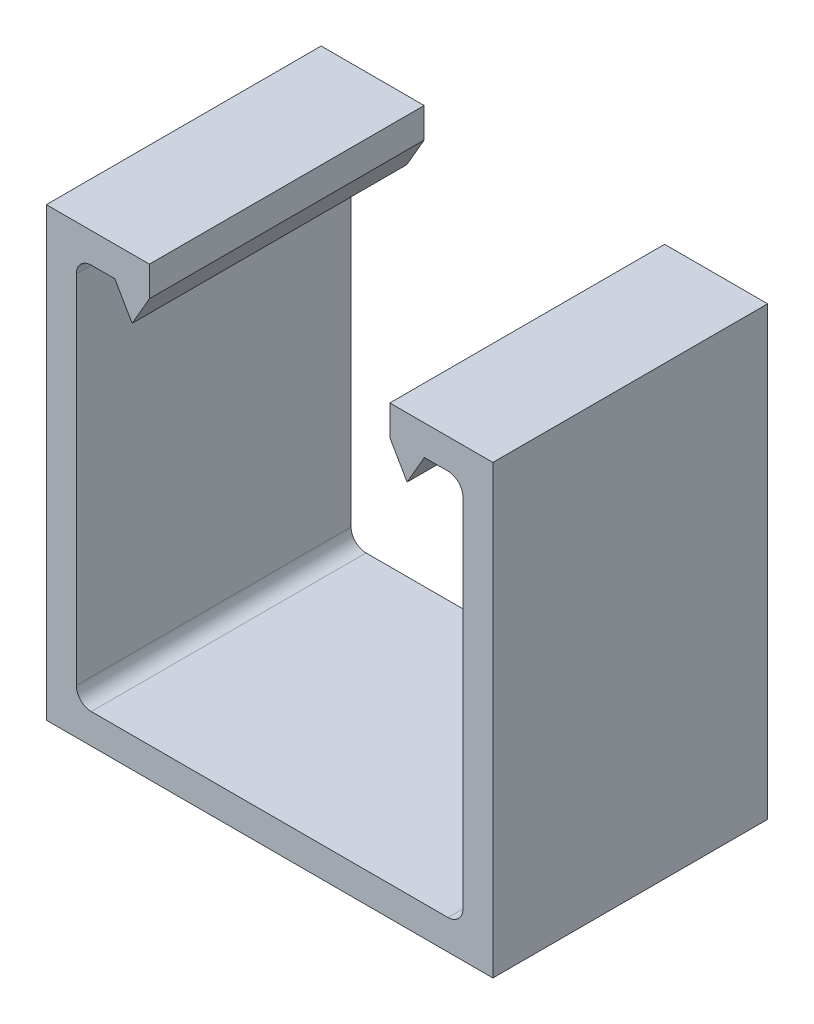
ISO-10303-21;
HEADER;
FILE_DESCRIPTION(('STEP AP214'),'2;1');
FILE_NAME('part.step','',(''),(''),'','','');
FILE_SCHEMA(('AUTOMOTIVE_DESIGN { 1 0 10303 214 1 1 1 1 }'));
ENDSEC;
DATA;
#1=APPLICATION_CONTEXT('core data for automotive mechanical design processes');
#2=APPLICATION_PROTOCOL_DEFINITION('international standard','automotive_design',2000,#1);
#3=PRODUCT_CONTEXT('',#1,'mechanical');
#4=PRODUCT('Part','Part','',(#3));
#5=PRODUCT_RELATED_PRODUCT_CATEGORY('part','',(#4));
#6=PRODUCT_DEFINITION_FORMATION('','',#4);
#7=PRODUCT_DEFINITION_CONTEXT('part definition',#1,'design');
#8=PRODUCT_DEFINITION('design','',#6,#7);
#9=PRODUCT_DEFINITION_SHAPE('','',#8);
#10=(LENGTH_UNIT() NAMED_UNIT(*) SI_UNIT(.MILLI.,.METRE.));
#11=(NAMED_UNIT(*) PLANE_ANGLE_UNIT() SI_UNIT($,.RADIAN.));
#12=(NAMED_UNIT(*) SI_UNIT($,.STERADIAN.) SOLID_ANGLE_UNIT());
#13=UNCERTAINTY_MEASURE_WITH_UNIT(LENGTH_MEASURE(1.E-05),#10,'distance_accuracy_value','');
#14=(GEOMETRIC_REPRESENTATION_CONTEXT(3) GLOBAL_UNCERTAINTY_ASSIGNED_CONTEXT((#13)) GLOBAL_UNIT_ASSIGNED_CONTEXT((#10,
#11,#12)) REPRESENTATION_CONTEXT('',''));
#15=CARTESIAN_POINT('',(0.,0.,0.));
#16=DIRECTION('',(0.,0.,1.));
#17=DIRECTION('',(1.,0.,0.));
#18=AXIS2_PLACEMENT_3D('',#15,#16,#17);
#19=CARTESIAN_POINT('',(-16.4846,-16.4846,12.7));
#20=DIRECTION('',(0.,0.,-1.));
#21=DIRECTION('',(-1.,0.,0.));
#22=AXIS2_PLACEMENT_3D('',#19,#20,#21);
#23=CYLINDRICAL_SURFACE('',#22,1.3843);
#24=CARTESIAN_POINT('',(-16.4846,-16.4846,-12.7));
#25=DIRECTION('',(0.,0.,-1.));
#26=DIRECTION('',(1.,0.,0.));
#27=AXIS2_PLACEMENT_3D('',#24,#25,#26);
#28=CIRCLE('',#27,1.3843);
#29=CARTESIAN_POINT('',(-16.4846,-17.8689,-12.7));
#30=VERTEX_POINT('',#29);
#31=CARTESIAN_POINT('',(-17.8689,-16.4846,-12.7));
#32=VERTEX_POINT('',#31);
#33=EDGE_CURVE('E210',#30,#32,#28,.T.);
#34=ORIENTED_EDGE('',*,*,#33,.T.);
#35=DIRECTION('',(0.,0.,-1.));
#36=VECTOR('',#35,1.);
#37=CARTESIAN_POINT('',(-17.8689,-16.4846,12.7));
#38=LINE('',#37,#36);
#39=CARTESIAN_POINT('',(-17.8689,-16.4846,12.7));
#40=VERTEX_POINT('',#39);
#41=EDGE_CURVE('E11',#40,#32,#38,.T.);
#42=ORIENTED_EDGE('',*,*,#41,.F.);
#43=CARTESIAN_POINT('',(-16.4846,-16.4846,12.7));
#44=DIRECTION('',(0.,0.,-1.));
#45=DIRECTION('',(1.,0.,0.));
#46=AXIS2_PLACEMENT_3D('',#43,#44,#45);
#47=CIRCLE('',#46,1.3843);
#48=CARTESIAN_POINT('',(-16.4846,-17.8689,12.7));
#49=VERTEX_POINT('',#48);
#50=EDGE_CURVE('E244',#49,#40,#47,.T.);
#51=ORIENTED_EDGE('',*,*,#50,.F.);
#52=DIRECTION('',(0.,0.,-1.));
#53=VECTOR('',#52,1.);
#54=CARTESIAN_POINT('',(-16.4846,-17.8689,12.7));
#55=LINE('',#54,#53);
#56=EDGE_CURVE('E205',#49,#30,#55,.T.);
#57=ORIENTED_EDGE('',*,*,#56,.T.);
#58=EDGE_LOOP('',(#34,#42,#51,#57));
#59=FACE_BOUND('',#58,.T.);
#60=ADVANCED_FACE('F39',(#59),#23,.F.);
#61=CARTESIAN_POINT('',(-17.8689,16.4846,12.7));
#62=DIRECTION('',(-1.,0.,0.));
#63=DIRECTION('',(0.,0.,1.));
#64=AXIS2_PLACEMENT_3D('',#61,#62,#63);
#65=PLANE('',#64);
#66=DIRECTION('',(0.,1.,0.));
#67=VECTOR('',#66,1.);
#68=CARTESIAN_POINT('',(-17.8689,16.4846,-12.7));
#69=LINE('',#68,#67);
#70=CARTESIAN_POINT('',(-17.8689,16.4846,-12.7));
#71=VERTEX_POINT('',#70);
#72=EDGE_CURVE('E208',#32,#71,#69,.T.);
#73=ORIENTED_EDGE('',*,*,#72,.T.);
#74=DIRECTION('',(0.,0.,-1.));
#75=VECTOR('',#74,1.);
#76=CARTESIAN_POINT('',(-17.8689,16.4846,12.7));
#77=LINE('',#76,#75);
#78=CARTESIAN_POINT('',(-17.8689,16.4846,12.7));
#79=VERTEX_POINT('',#78);
#80=EDGE_CURVE('E50',#79,#71,#77,.T.);
#81=ORIENTED_EDGE('',*,*,#80,.F.);
#82=DIRECTION('',(0.,1.,0.));
#83=VECTOR('',#82,1.);
#84=CARTESIAN_POINT('',(-17.8689,16.4846,12.7));
#85=LINE('',#84,#83);
#86=EDGE_CURVE('E135',#40,#79,#85,.T.);
#87=ORIENTED_EDGE('',*,*,#86,.F.);
#88=ORIENTED_EDGE('',*,*,#41,.T.);
#89=EDGE_LOOP('',(#73,#81,#87,#88));
#90=FACE_BOUND('',#89,.T.);
#91=ADVANCED_FACE('F361',(#90),#65,.F.);
#92=CARTESIAN_POINT('',(-16.4846,16.4846,12.7));
#93=DIRECTION('',(0.,0.,-1.));
#94=DIRECTION('',(-1.,0.,0.));
#95=AXIS2_PLACEMENT_3D('',#92,#93,#94);
#96=CYLINDRICAL_SURFACE('',#95,1.3843);
#97=CARTESIAN_POINT('',(-16.4846,16.4846,-12.7));
#98=DIRECTION('',(0.,0.,-1.));
#99=DIRECTION('',(1.,0.,0.));
#100=AXIS2_PLACEMENT_3D('',#97,#98,#99);
#101=CIRCLE('',#100,1.3843);
#102=CARTESIAN_POINT('',(-16.4846,17.8689,-12.7));
#103=VERTEX_POINT('',#102);
#104=EDGE_CURVE('E215',#71,#103,#101,.T.);
#105=ORIENTED_EDGE('',*,*,#104,.T.);
#106=DIRECTION('',(0.,0.,-1.));
#107=VECTOR('',#106,1.);
#108=CARTESIAN_POINT('',(-16.4846,17.8689,12.7));
#109=LINE('',#108,#107);
#110=CARTESIAN_POINT('',(-16.4846,17.8689,12.7));
#111=VERTEX_POINT('',#110);
#112=EDGE_CURVE('E290',#111,#103,#109,.T.);
#113=ORIENTED_EDGE('',*,*,#112,.F.);
#114=CARTESIAN_POINT('',(-16.4846,16.4846,12.7));
#115=DIRECTION('',(0.,0.,-1.));
#116=DIRECTION('',(1.,0.,0.));
#117=AXIS2_PLACEMENT_3D('',#114,#115,#116);
#118=CIRCLE('',#117,1.3843);
#119=EDGE_CURVE('E298',#79,#111,#118,.T.);
#120=ORIENTED_EDGE('',*,*,#119,.F.);
#121=ORIENTED_EDGE('',*,*,#80,.T.);
#122=EDGE_LOOP('',(#105,#113,#120,#121));
#123=FACE_BOUND('',#122,.T.);
#124=ADVANCED_FACE('F295',(#123),#96,.F.);
#125=CARTESIAN_POINT('',(-14.3094039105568,17.8689,12.7));
#126=DIRECTION('',(0.,1.,0.));
#127=DIRECTION('',(-1.,0.,0.));
#128=AXIS2_PLACEMENT_3D('',#125,#126,#127);
#129=PLANE('',#128);
#130=DIRECTION('',(1.,0.,0.));
#131=VECTOR('',#130,1.);
#132=CARTESIAN_POINT('',(-14.3094039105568,17.8689,-12.7));
#133=LINE('',#132,#131);
#134=CARTESIAN_POINT('',(-14.3094039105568,17.8689,-12.7));
#135=VERTEX_POINT('',#134);
#136=EDGE_CURVE('E211',#103,#135,#133,.T.);
#137=ORIENTED_EDGE('',*,*,#136,.T.);
#138=DIRECTION('',(0.,0.,-1.));
#139=VECTOR('',#138,1.);
#140=CARTESIAN_POINT('',(-14.3094039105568,17.8689,12.7));
#141=LINE('',#140,#139);
#142=CARTESIAN_POINT('',(-14.3094039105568,17.8689,12.7));
#143=VERTEX_POINT('',#142);
#144=EDGE_CURVE('E281',#143,#135,#141,.T.);
#145=ORIENTED_EDGE('',*,*,#144,.F.);
#146=DIRECTION('',(1.,0.,0.));
#147=VECTOR('',#146,1.);
#148=CARTESIAN_POINT('',(-14.3094039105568,17.8689,12.7));
#149=LINE('',#148,#147);
#150=EDGE_CURVE('E313',#111,#143,#149,.T.);
#151=ORIENTED_EDGE('',*,*,#150,.F.);
#152=ORIENTED_EDGE('',*,*,#112,.T.);
#153=EDGE_LOOP('',(#137,#145,#151,#152));
#154=FACE_BOUND('',#153,.T.);
#155=ADVANCED_FACE('F304',(#154),#129,.F.);
#156=CARTESIAN_POINT('',(-14.3094039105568,17.8689,12.7));
#157=DIRECTION('',(0.866025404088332,0.499999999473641,0.));
#158=DIRECTION('',(-0.499999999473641,0.866025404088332,0.));
#159=AXIS2_PLACEMENT_3D('',#156,#157,#158);
#160=PLANE('',#159);
#161=DIRECTION('',(0.499999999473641,-0.866025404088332,0.));
#162=VECTOR('',#161,1.);
#163=CARTESIAN_POINT('',(-14.3094039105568,17.8689,-12.7));
#164=LINE('',#163,#162);
#165=CARTESIAN_POINT('',(-12.710951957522,15.1003,-12.7));
#166=VERTEX_POINT('',#165);
#167=EDGE_CURVE('E218',#135,#166,#164,.T.);
#168=ORIENTED_EDGE('',*,*,#167,.T.);
#169=DIRECTION('',(0.,0.,-1.));
#170=VECTOR('',#169,1.);
#171=CARTESIAN_POINT('',(-12.710951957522,15.1003,12.7));
#172=LINE('',#171,#170);
#173=CARTESIAN_POINT('',(-12.710951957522,15.1003,12.7));
#174=VERTEX_POINT('',#173);
#175=EDGE_CURVE('E284',#174,#166,#172,.T.);
#176=ORIENTED_EDGE('',*,*,#175,.F.);
#177=DIRECTION('',(0.499999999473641,-0.866025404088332,0.));
#178=VECTOR('',#177,1.);
#179=CARTESIAN_POINT('',(-14.3094039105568,17.8689,12.7));
#180=LINE('',#179,#178);
#181=EDGE_CURVE('E311',#143,#174,#180,.T.);
#182=ORIENTED_EDGE('',*,*,#181,.F.);
#183=ORIENTED_EDGE('',*,*,#144,.T.);
#184=EDGE_LOOP('',(#168,#176,#182,#183));
#185=FACE_BOUND('',#184,.T.);
#186=ADVANCED_FACE('F307',(#185),#160,.F.);
#187=CARTESIAN_POINT('',(-12.710951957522,15.1003,12.7));
#188=DIRECTION('',(-0.866025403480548,0.500000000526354,0.));
#189=DIRECTION('',(-0.500000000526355,-0.866025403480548,0.));
#190=AXIS2_PLACEMENT_3D('',#187,#188,#189);
#191=PLANE('',#190);
#192=DIRECTION('',(0.500000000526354,0.866025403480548,0.));
#193=VECTOR('',#192,1.);
#194=CARTESIAN_POINT('',(-12.710951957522,15.1003,-12.7));
#195=LINE('',#194,#193);
#196=CARTESIAN_POINT('',(-11.1125,17.8689,-12.7));
#197=VERTEX_POINT('',#196);
#198=EDGE_CURVE('E217',#166,#197,#195,.T.);
#199=ORIENTED_EDGE('',*,*,#198,.T.);
#200=DIRECTION('',(0.,0.,-1.));
#201=VECTOR('',#200,1.);
#202=CARTESIAN_POINT('',(-11.1125,17.8689,12.7));
#203=LINE('',#202,#201);
#204=CARTESIAN_POINT('',(-11.1125,17.8689,12.7));
#205=VERTEX_POINT('',#204);
#206=EDGE_CURVE('E276',#205,#197,#203,.T.);
#207=ORIENTED_EDGE('',*,*,#206,.F.);
#208=DIRECTION('',(0.500000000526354,0.866025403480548,0.));
#209=VECTOR('',#208,1.);
#210=CARTESIAN_POINT('',(-12.710951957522,15.1003,12.7));
#211=LINE('',#210,#209);
#212=EDGE_CURVE('E312',#174,#205,#211,.T.);
#213=ORIENTED_EDGE('',*,*,#212,.F.);
#214=ORIENTED_EDGE('',*,*,#175,.T.);
#215=EDGE_LOOP('',(#199,#207,#213,#214));
#216=FACE_BOUND('',#215,.T.);
#217=ADVANCED_FACE('F376',(#216),#191,.F.);
#218=CARTESIAN_POINT('',(-11.1125,17.8689,12.7));
#219=DIRECTION('',(-1.,0.,0.));
#220=DIRECTION('',(0.,-1.,0.));
#221=AXIS2_PLACEMENT_3D('',#218,#219,#220);
#222=PLANE('',#221);
#223=DIRECTION('',(0.,1.,0.));
#224=VECTOR('',#223,1.);
#225=CARTESIAN_POINT('',(-11.1125,17.8689,-12.7));
#226=LINE('',#225,#224);
#227=CARTESIAN_POINT('',(-11.1125,20.6375,-12.7));
#228=VERTEX_POINT('',#227);
#229=EDGE_CURVE('E216',#197,#228,#226,.T.);
#230=ORIENTED_EDGE('',*,*,#229,.T.);
#231=DIRECTION('',(0.,0.,-1.));
#232=VECTOR('',#231,1.);
#233=CARTESIAN_POINT('',(-11.1125,20.6375,12.7));
#234=LINE('',#233,#232);
#235=CARTESIAN_POINT('',(-11.1125,20.6375,12.7));
#236=VERTEX_POINT('',#235);
#237=EDGE_CURVE('E277',#236,#228,#234,.T.);
#238=ORIENTED_EDGE('',*,*,#237,.F.);
#239=DIRECTION('',(0.,1.,0.));
#240=VECTOR('',#239,1.);
#241=CARTESIAN_POINT('',(-11.1125,17.8689,12.7));
#242=LINE('',#241,#240);
#243=EDGE_CURVE('E317',#205,#236,#242,.T.);
#244=ORIENTED_EDGE('',*,*,#243,.F.);
#245=ORIENTED_EDGE('',*,*,#206,.T.);
#246=EDGE_LOOP('',(#230,#238,#244,#245));
#247=FACE_BOUND('',#246,.T.);
#248=ADVANCED_FACE('F378',(#247),#222,.F.);
#249=CARTESIAN_POINT('',(-11.1125,20.6375,12.7));
#250=DIRECTION('',(0.,-1.,0.));
#251=DIRECTION('',(1.,0.,0.));
#252=AXIS2_PLACEMENT_3D('',#249,#250,#251);
#253=PLANE('',#252);
#254=DIRECTION('',(-1.,0.,0.));
#255=VECTOR('',#254,1.);
#256=CARTESIAN_POINT('',(-11.1125,20.6375,-12.7));
#257=LINE('',#256,#255);
#258=CARTESIAN_POINT('',(-20.6375,20.6375,-12.7));
#259=VERTEX_POINT('',#258);
#260=EDGE_CURVE('E224',#228,#259,#257,.T.);
#261=ORIENTED_EDGE('',*,*,#260,.T.);
#262=DIRECTION('',(0.,0.,-1.));
#263=VECTOR('',#262,1.);
#264=CARTESIAN_POINT('',(-20.6375,20.6375,12.7));
#265=LINE('',#264,#263);
#266=CARTESIAN_POINT('',(-20.6375,20.6375,12.7));
#267=VERTEX_POINT('',#266);
#268=EDGE_CURVE('E271',#267,#259,#265,.T.);
#269=ORIENTED_EDGE('',*,*,#268,.F.);
#270=DIRECTION('',(-1.,0.,0.));
#271=VECTOR('',#270,1.);
#272=CARTESIAN_POINT('',(-11.1125,20.6375,12.7));
#273=LINE('',#272,#271);
#274=EDGE_CURVE('E325',#236,#267,#273,.T.);
#275=ORIENTED_EDGE('',*,*,#274,.F.);
#276=ORIENTED_EDGE('',*,*,#237,.T.);
#277=EDGE_LOOP('',(#261,#269,#275,#276));
#278=FACE_BOUND('',#277,.T.);
#279=ADVANCED_FACE('F384',(#278),#253,.F.);
#280=CARTESIAN_POINT('',(-20.6375,20.6375,12.7));
#281=DIRECTION('',(1.,0.,0.));
#282=DIRECTION('',(0.,1.,0.));
#283=AXIS2_PLACEMENT_3D('',#280,#281,#282);
#284=PLANE('',#283);
#285=DIRECTION('',(0.,-1.,0.));
#286=VECTOR('',#285,1.);
#287=CARTESIAN_POINT('',(-20.6375,20.6375,-12.7));
#288=LINE('',#287,#286);
#289=CARTESIAN_POINT('',(-20.6375,-20.6375,-12.7));
#290=VERTEX_POINT('',#289);
#291=EDGE_CURVE('E221',#259,#290,#288,.T.);
#292=ORIENTED_EDGE('',*,*,#291,.T.);
#293=DIRECTION('',(0.,0.,-1.));
#294=VECTOR('',#293,1.);
#295=CARTESIAN_POINT('',(-20.6375,-20.6375,12.7));
#296=LINE('',#295,#294);
#297=CARTESIAN_POINT('',(-20.6375,-20.6375,12.7));
#298=VERTEX_POINT('',#297);
#299=EDGE_CURVE('E268',#298,#290,#296,.T.);
#300=ORIENTED_EDGE('',*,*,#299,.F.);
#301=DIRECTION('',(0.,-1.,0.));
#302=VECTOR('',#301,1.);
#303=CARTESIAN_POINT('',(-20.6375,20.6375,12.7));
#304=LINE('',#303,#302);
#305=EDGE_CURVE('E321',#267,#298,#304,.T.);
#306=ORIENTED_EDGE('',*,*,#305,.F.);
#307=ORIENTED_EDGE('',*,*,#268,.T.);
#308=EDGE_LOOP('',(#292,#300,#306,#307));
#309=FACE_BOUND('',#308,.T.);
#310=ADVANCED_FACE('F390',(#309),#284,.F.);
#311=CARTESIAN_POINT('',(-20.6375,-20.6375,12.7));
#312=DIRECTION('',(0.,1.,0.));
#313=DIRECTION('',(0.,0.,1.));
#314=AXIS2_PLACEMENT_3D('',#311,#312,#313);
#315=PLANE('',#314);
#316=DIRECTION('',(1.,0.,0.));
#317=VECTOR('',#316,1.);
#318=CARTESIAN_POINT('',(-20.6375,-20.6375,-12.7));
#319=LINE('',#318,#317);
#320=CARTESIAN_POINT('',(20.6375,-20.6375,-12.7));
#321=VERTEX_POINT('',#320);
#322=EDGE_CURVE('E228',#290,#321,#319,.T.);
#323=ORIENTED_EDGE('',*,*,#322,.T.);
#324=DIRECTION('',(0.,0.,-1.));
#325=VECTOR('',#324,1.);
#326=CARTESIAN_POINT('',(20.6375,-20.6375,12.7));
#327=LINE('',#326,#325);
#328=CARTESIAN_POINT('',(20.6375,-20.6375,12.7));
#329=VERTEX_POINT('',#328);
#330=EDGE_CURVE('E269',#329,#321,#327,.T.);
#331=ORIENTED_EDGE('',*,*,#330,.F.);
#332=DIRECTION('',(1.,0.,0.));
#333=VECTOR('',#332,1.);
#334=CARTESIAN_POINT('',(-20.6375,-20.6375,12.7));
#335=LINE('',#334,#333);
#336=EDGE_CURVE('E328',#298,#329,#335,.T.);
#337=ORIENTED_EDGE('',*,*,#336,.F.);
#338=ORIENTED_EDGE('',*,*,#299,.T.);
#339=EDGE_LOOP('',(#323,#331,#337,#338));
#340=FACE_BOUND('',#339,.T.);
#341=ADVANCED_FACE('F393',(#340),#315,.F.);
#342=CARTESIAN_POINT('',(20.6375,-20.6375,12.7));
#343=DIRECTION('',(-1.,0.,0.));
#344=DIRECTION('',(0.,0.,1.));
#345=AXIS2_PLACEMENT_3D('',#342,#343,#344);
#346=PLANE('',#345);
#347=DIRECTION('',(0.,1.,0.));
#348=VECTOR('',#347,1.);
#349=CARTESIAN_POINT('',(20.6375,-20.6375,-12.7));
#350=LINE('',#349,#348);
#351=CARTESIAN_POINT('',(20.6375,20.6375,-12.7));
#352=VERTEX_POINT('',#351);
#353=EDGE_CURVE('E226',#321,#352,#350,.T.);
#354=ORIENTED_EDGE('',*,*,#353,.T.);
#355=DIRECTION('',(0.,0.,-1.));
#356=VECTOR('',#355,1.);
#357=CARTESIAN_POINT('',(20.6375,20.6375,12.7));
#358=LINE('',#357,#356);
#359=CARTESIAN_POINT('',(20.6375,20.6375,12.7));
#360=VERTEX_POINT('',#359);
#361=EDGE_CURVE('E265',#360,#352,#358,.T.);
#362=ORIENTED_EDGE('',*,*,#361,.F.);
#363=DIRECTION('',(0.,1.,0.));
#364=VECTOR('',#363,1.);
#365=CARTESIAN_POINT('',(20.6375,-20.6375,12.7));
#366=LINE('',#365,#364);
#367=EDGE_CURVE('E327',#329,#360,#366,.T.);
#368=ORIENTED_EDGE('',*,*,#367,.F.);
#369=ORIENTED_EDGE('',*,*,#330,.T.);
#370=EDGE_LOOP('',(#354,#362,#368,#369));
#371=FACE_BOUND('',#370,.T.);
#372=ADVANCED_FACE('F391',(#371),#346,.F.);
#373=CARTESIAN_POINT('',(20.6375,20.6375,12.7));
#374=DIRECTION('',(0.,-1.,0.));
#375=DIRECTION('',(0.,0.,-1.));
#376=AXIS2_PLACEMENT_3D('',#373,#374,#375);
#377=PLANE('',#376);
#378=DIRECTION('',(-1.,0.,0.));
#379=VECTOR('',#378,1.);
#380=CARTESIAN_POINT('',(20.6375,20.6375,-12.7));
#381=LINE('',#380,#379);
#382=CARTESIAN_POINT('',(11.1125,20.6375,-12.7));
#383=VERTEX_POINT('',#382);
#384=EDGE_CURVE('E229',#352,#383,#381,.T.);
#385=ORIENTED_EDGE('',*,*,#384,.T.);
#386=DIRECTION('',(0.,0.,-1.));
#387=VECTOR('',#386,1.);
#388=CARTESIAN_POINT('',(11.1125,20.6375,12.7));
#389=LINE('',#388,#387);
#390=CARTESIAN_POINT('',(11.1125,20.6375,12.7));
#391=VERTEX_POINT('',#390);
#392=EDGE_CURVE('E263',#391,#383,#389,.T.);
#393=ORIENTED_EDGE('',*,*,#392,.F.);
#394=DIRECTION('',(-1.,0.,0.));
#395=VECTOR('',#394,1.);
#396=CARTESIAN_POINT('',(20.6375,20.6375,12.7));
#397=LINE('',#396,#395);
#398=EDGE_CURVE('E326',#360,#391,#397,.T.);
#399=ORIENTED_EDGE('',*,*,#398,.F.);
#400=ORIENTED_EDGE('',*,*,#361,.T.);
#401=EDGE_LOOP('',(#385,#393,#399,#400));
#402=FACE_BOUND('',#401,.T.);
#403=ADVANCED_FACE('F396',(#402),#377,.F.);
#404=CARTESIAN_POINT('',(11.1125,17.8689,12.7));
#405=DIRECTION('',(1.,0.,0.));
#406=DIRECTION('',(0.,0.,-1.));
#407=AXIS2_PLACEMENT_3D('',#404,#405,#406);
#408=PLANE('',#407);
#409=DIRECTION('',(0.,-1.,0.));
#410=VECTOR('',#409,1.);
#411=CARTESIAN_POINT('',(11.1125,17.8689,-12.7));
#412=LINE('',#411,#410);
#413=CARTESIAN_POINT('',(11.1125,17.8689,-12.7));
#414=VERTEX_POINT('',#413);
#415=EDGE_CURVE('E235',#383,#414,#412,.T.);
#416=ORIENTED_EDGE('',*,*,#415,.T.);
#417=DIRECTION('',(0.,0.,-1.));
#418=VECTOR('',#417,1.);
#419=CARTESIAN_POINT('',(11.1125,17.8689,12.7));
#420=LINE('',#419,#418);
#421=CARTESIAN_POINT('',(11.1125,17.8689,12.7));
#422=VERTEX_POINT('',#421);
#423=EDGE_CURVE('E259',#422,#414,#420,.T.);
#424=ORIENTED_EDGE('',*,*,#423,.F.);
#425=DIRECTION('',(0.,-1.,0.));
#426=VECTOR('',#425,1.);
#427=CARTESIAN_POINT('',(11.1125,17.8689,12.7));
#428=LINE('',#427,#426);
#429=EDGE_CURVE('E334',#391,#422,#428,.T.);
#430=ORIENTED_EDGE('',*,*,#429,.F.);
#431=ORIENTED_EDGE('',*,*,#392,.T.);
#432=EDGE_LOOP('',(#416,#424,#430,#431));
#433=FACE_BOUND('',#432,.T.);
#434=ADVANCED_FACE('F401',(#433),#408,.F.);
#435=CARTESIAN_POINT('',(12.710951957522,15.1003,12.7));
#436=DIRECTION('',(0.866025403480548,0.500000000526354,0.));
#437=DIRECTION('',(-0.500000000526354,0.866025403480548,0.));
#438=AXIS2_PLACEMENT_3D('',#435,#436,#437);
#439=PLANE('',#438);
#440=DIRECTION('',(0.500000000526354,-0.866025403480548,0.));
#441=VECTOR('',#440,1.);
#442=CARTESIAN_POINT('',(12.710951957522,15.1003,-12.7));
#443=LINE('',#442,#441);
#444=CARTESIAN_POINT('',(12.710951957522,15.1003,-12.7));
#445=VERTEX_POINT('',#444);
#446=EDGE_CURVE('E234',#414,#445,#443,.T.);
#447=ORIENTED_EDGE('',*,*,#446,.T.);
#448=DIRECTION('',(0.,0.,-1.));
#449=VECTOR('',#448,1.);
#450=CARTESIAN_POINT('',(12.710951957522,15.1003,12.7));
#451=LINE('',#450,#449);
#452=CARTESIAN_POINT('',(12.710951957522,15.1003,12.7));
#453=VERTEX_POINT('',#452);
#454=EDGE_CURVE('E253',#453,#445,#451,.T.);
#455=ORIENTED_EDGE('',*,*,#454,.F.);
#456=DIRECTION('',(0.500000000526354,-0.866025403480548,0.));
#457=VECTOR('',#456,1.);
#458=CARTESIAN_POINT('',(12.710951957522,15.1003,12.7));
#459=LINE('',#458,#457);
#460=EDGE_CURVE('E331',#422,#453,#459,.T.);
#461=ORIENTED_EDGE('',*,*,#460,.F.);
#462=ORIENTED_EDGE('',*,*,#423,.T.);
#463=EDGE_LOOP('',(#447,#455,#461,#462));
#464=FACE_BOUND('',#463,.T.);
#465=ADVANCED_FACE('F410',(#464),#439,.F.);
#466=CARTESIAN_POINT('',(14.3094039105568,17.8689,12.7));
#467=DIRECTION('',(-0.866025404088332,0.499999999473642,0.));
#468=DIRECTION('',(-0.499999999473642,-0.866025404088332,0.));
#469=AXIS2_PLACEMENT_3D('',#466,#467,#468);
#470=PLANE('',#469);
#471=DIRECTION('',(0.499999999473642,0.866025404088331,0.));
#472=VECTOR('',#471,1.);
#473=CARTESIAN_POINT('',(14.3094039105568,17.8689,-12.7));
#474=LINE('',#473,#472);
#475=CARTESIAN_POINT('',(14.3094039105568,17.8689,-12.7));
#476=VERTEX_POINT('',#475);
#477=EDGE_CURVE('E236',#445,#476,#474,.T.);
#478=ORIENTED_EDGE('',*,*,#477,.T.);
#479=DIRECTION('',(0.,0.,-1.));
#480=VECTOR('',#479,1.);
#481=CARTESIAN_POINT('',(14.3094039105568,17.8689,12.7));
#482=LINE('',#481,#480);
#483=CARTESIAN_POINT('',(14.3094039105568,17.8689,12.7));
#484=VERTEX_POINT('',#483);
#485=EDGE_CURVE('E255',#484,#476,#482,.T.);
#486=ORIENTED_EDGE('',*,*,#485,.F.);
#487=DIRECTION('',(0.499999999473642,0.866025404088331,0.));
#488=VECTOR('',#487,1.);
#489=CARTESIAN_POINT('',(14.3094039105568,17.8689,12.7));
#490=LINE('',#489,#488);
#491=EDGE_CURVE('E337',#453,#484,#490,.T.);
#492=ORIENTED_EDGE('',*,*,#491,.F.);
#493=ORIENTED_EDGE('',*,*,#454,.T.);
#494=EDGE_LOOP('',(#478,#486,#492,#493));
#495=FACE_BOUND('',#494,.T.);
#496=ADVANCED_FACE('F413',(#495),#470,.F.);
#497=CARTESIAN_POINT('',(16.4846,17.8689,12.7));
#498=DIRECTION('',(0.,1.,0.));
#499=DIRECTION('',(-1.,0.,0.));
#500=AXIS2_PLACEMENT_3D('',#497,#498,#499);
#501=PLANE('',#500);
#502=DIRECTION('',(1.,0.,0.));
#503=VECTOR('',#502,1.);
#504=CARTESIAN_POINT('',(16.4846,17.8689,-12.7));
#505=LINE('',#504,#503);
#506=CARTESIAN_POINT('',(16.4846,17.8689,-12.7));
#507=VERTEX_POINT('',#506);
#508=EDGE_CURVE('E238',#476,#507,#505,.T.);
#509=ORIENTED_EDGE('',*,*,#508,.T.);
#510=DIRECTION('',(0.,0.,-1.));
#511=VECTOR('',#510,1.);
#512=CARTESIAN_POINT('',(16.4846,17.8689,12.7));
#513=LINE('',#512,#511);
#514=CARTESIAN_POINT('',(16.4846,17.8689,12.7));
#515=VERTEX_POINT('',#514);
#516=EDGE_CURVE('E248',#515,#507,#513,.T.);
#517=ORIENTED_EDGE('',*,*,#516,.F.);
#518=DIRECTION('',(1.,0.,0.));
#519=VECTOR('',#518,1.);
#520=CARTESIAN_POINT('',(16.4846,17.8689,12.7));
#521=LINE('',#520,#519);
#522=EDGE_CURVE('E336',#484,#515,#521,.T.);
#523=ORIENTED_EDGE('',*,*,#522,.F.);
#524=ORIENTED_EDGE('',*,*,#485,.T.);
#525=EDGE_LOOP('',(#509,#517,#523,#524));
#526=FACE_BOUND('',#525,.T.);
#527=ADVANCED_FACE('F341',(#526),#501,.F.);
#528=CARTESIAN_POINT('',(16.4846,16.4846,12.7));
#529=DIRECTION('',(0.,0.,-1.));
#530=DIRECTION('',(-1.,0.,0.));
#531=AXIS2_PLACEMENT_3D('',#528,#529,#530);
#532=CYLINDRICAL_SURFACE('',#531,1.3843);
#533=CARTESIAN_POINT('',(16.4846,16.4846,-12.7));
#534=DIRECTION('',(0.,0.,-1.));
#535=DIRECTION('',(1.,0.,0.));
#536=AXIS2_PLACEMENT_3D('',#533,#534,#535);
#537=CIRCLE('',#536,1.3843);
#538=CARTESIAN_POINT('',(17.8689,16.4846,-12.7));
#539=VERTEX_POINT('',#538);
#540=EDGE_CURVE('E239',#507,#539,#537,.T.);
#541=ORIENTED_EDGE('',*,*,#540,.T.);
#542=DIRECTION('',(0.,0.,-1.));
#543=VECTOR('',#542,1.);
#544=CARTESIAN_POINT('',(17.8689,16.4846,12.7));
#545=LINE('',#544,#543);
#546=CARTESIAN_POINT('',(17.8689,16.4846,12.7));
#547=VERTEX_POINT('',#546);
#548=EDGE_CURVE('E197',#547,#539,#545,.T.);
#549=ORIENTED_EDGE('',*,*,#548,.F.);
#550=CARTESIAN_POINT('',(16.4846,16.4846,12.7));
#551=DIRECTION('',(0.,0.,-1.));
#552=DIRECTION('',(1.,0.,0.));
#553=AXIS2_PLACEMENT_3D('',#550,#551,#552);
#554=CIRCLE('',#553,1.3843);
#555=EDGE_CURVE('E186',#515,#547,#554,.T.);
#556=ORIENTED_EDGE('',*,*,#555,.F.);
#557=ORIENTED_EDGE('',*,*,#516,.T.);
#558=EDGE_LOOP('',(#541,#549,#556,#557));
#559=FACE_BOUND('',#558,.T.);
#560=ADVANCED_FACE('F347',(#559),#532,.F.);
#561=CARTESIAN_POINT('',(17.8689,-16.4846,12.7));
#562=DIRECTION('',(1.,0.,0.));
#563=DIRECTION('',(0.,1.,0.));
#564=AXIS2_PLACEMENT_3D('',#561,#562,#563);
#565=PLANE('',#564);
#566=DIRECTION('',(0.,-1.,0.));
#567=VECTOR('',#566,1.);
#568=CARTESIAN_POINT('',(17.8689,-16.4846,-12.7));
#569=LINE('',#568,#567);
#570=CARTESIAN_POINT('',(17.8689,-16.4846,-12.7));
#571=VERTEX_POINT('',#570);
#572=EDGE_CURVE('E199',#539,#571,#569,.T.);
#573=ORIENTED_EDGE('',*,*,#572,.T.);
#574=DIRECTION('',(0.,0.,-1.));
#575=VECTOR('',#574,1.);
#576=CARTESIAN_POINT('',(17.8689,-16.4846,12.7));
#577=LINE('',#576,#575);
#578=CARTESIAN_POINT('',(17.8689,-16.4846,12.7));
#579=VERTEX_POINT('',#578);
#580=EDGE_CURVE('E191',#579,#571,#577,.T.);
#581=ORIENTED_EDGE('',*,*,#580,.F.);
#582=DIRECTION('',(0.,-1.,0.));
#583=VECTOR('',#582,1.);
#584=CARTESIAN_POINT('',(17.8689,-16.4846,12.7));
#585=LINE('',#584,#583);
#586=EDGE_CURVE('E182',#547,#579,#585,.T.);
#587=ORIENTED_EDGE('',*,*,#586,.F.);
#588=ORIENTED_EDGE('',*,*,#548,.T.);
#589=EDGE_LOOP('',(#573,#581,#587,#588));
#590=FACE_BOUND('',#589,.T.);
#591=ADVANCED_FACE('F193',(#590),#565,.F.);
#592=CARTESIAN_POINT('',(16.4846,-16.4846,12.7));
#593=DIRECTION('',(0.,0.,-1.));
#594=DIRECTION('',(-1.,0.,0.));
#595=AXIS2_PLACEMENT_3D('',#592,#593,#594);
#596=CYLINDRICAL_SURFACE('',#595,1.3843);
#597=CARTESIAN_POINT('',(16.4846,-16.4846,-12.7));
#598=DIRECTION('',(0.,0.,-1.));
#599=DIRECTION('',(1.,0.,0.));
#600=AXIS2_PLACEMENT_3D('',#597,#598,#599);
#601=CIRCLE('',#600,1.3843);
#602=CARTESIAN_POINT('',(16.4846,-17.8689,-12.7));
#603=VERTEX_POINT('',#602);
#604=EDGE_CURVE('E119',#571,#603,#601,.T.);
#605=ORIENTED_EDGE('',*,*,#604,.T.);
#606=DIRECTION('',(0.,0.,-1.));
#607=VECTOR('',#606,1.);
#608=CARTESIAN_POINT('',(16.4846,-17.8689,12.7));
#609=LINE('',#608,#607);
#610=CARTESIAN_POINT('',(16.4846,-17.8689,12.7));
#611=VERTEX_POINT('',#610);
#612=EDGE_CURVE('E200',#611,#603,#609,.T.);
#613=ORIENTED_EDGE('',*,*,#612,.F.);
#614=CARTESIAN_POINT('',(16.4846,-16.4846,12.7));
#615=DIRECTION('',(0.,0.,-1.));
#616=DIRECTION('',(1.,0.,0.));
#617=AXIS2_PLACEMENT_3D('',#614,#615,#616);
#618=CIRCLE('',#617,1.3843);
#619=EDGE_CURVE('E190',#579,#611,#618,.T.);
#620=ORIENTED_EDGE('',*,*,#619,.F.);
#621=ORIENTED_EDGE('',*,*,#580,.T.);
#622=EDGE_LOOP('',(#605,#613,#620,#621));
#623=FACE_BOUND('',#622,.T.);
#624=ADVANCED_FACE('F202',(#623),#596,.F.);
#625=CARTESIAN_POINT('',(-16.4846,-17.8689,12.7));
#626=DIRECTION('',(0.,-1.,0.));
#627=DIRECTION('',(0.,0.,-1.));
#628=AXIS2_PLACEMENT_3D('',#625,#626,#627);
#629=PLANE('',#628);
#630=DIRECTION('',(-1.,0.,0.));
#631=VECTOR('',#630,1.);
#632=CARTESIAN_POINT('',(-16.4846,-17.8689,-12.7));
#633=LINE('',#632,#631);
#634=EDGE_CURVE('E127',#603,#30,#633,.T.);
#635=ORIENTED_EDGE('',*,*,#634,.T.);
#636=ORIENTED_EDGE('',*,*,#56,.F.);
#637=DIRECTION('',(-1.,0.,0.));
#638=VECTOR('',#637,1.);
#639=CARTESIAN_POINT('',(-16.4846,-17.8689,12.7));
#640=LINE('',#639,#638);
#641=EDGE_CURVE('E54',#611,#49,#640,.T.);
#642=ORIENTED_EDGE('',*,*,#641,.F.);
#643=ORIENTED_EDGE('',*,*,#612,.T.);
#644=EDGE_LOOP('',(#635,#636,#642,#643));
#645=FACE_BOUND('',#644,.T.);
#646=ADVANCED_FACE('F354',(#645),#629,.F.);
#647=CARTESIAN_POINT('',(-16.4846,-16.4846,12.7));
#648=DIRECTION('',(0.,0.,1.));
#649=DIRECTION('',(1.,0.,0.));
#650=AXIS2_PLACEMENT_3D('',#647,#648,#649);
#651=PLANE('',#650);
#652=ORIENTED_EDGE('',*,*,#50,.T.);
#653=ORIENTED_EDGE('',*,*,#86,.T.);
#654=ORIENTED_EDGE('',*,*,#119,.T.);
#655=ORIENTED_EDGE('',*,*,#150,.T.);
#656=ORIENTED_EDGE('',*,*,#181,.T.);
#657=ORIENTED_EDGE('',*,*,#212,.T.);
#658=ORIENTED_EDGE('',*,*,#243,.T.);
#659=ORIENTED_EDGE('',*,*,#274,.T.);
#660=ORIENTED_EDGE('',*,*,#305,.T.);
#661=ORIENTED_EDGE('',*,*,#336,.T.);
#662=ORIENTED_EDGE('',*,*,#367,.T.);
#663=ORIENTED_EDGE('',*,*,#398,.T.);
#664=ORIENTED_EDGE('',*,*,#429,.T.);
#665=ORIENTED_EDGE('',*,*,#460,.T.);
#666=ORIENTED_EDGE('',*,*,#491,.T.);
#667=ORIENTED_EDGE('',*,*,#522,.T.);
#668=ORIENTED_EDGE('',*,*,#555,.T.);
#669=ORIENTED_EDGE('',*,*,#586,.T.);
#670=ORIENTED_EDGE('',*,*,#619,.T.);
#671=ORIENTED_EDGE('',*,*,#641,.T.);
#672=EDGE_LOOP('',(#652,#653,#654,#655,#656,#657,#658,#659,#660,#661,#662,#663,#664,#665,#666,
#667,#668,#669,#670,#671));
#673=FACE_BOUND('',#672,.T.);
#674=ADVANCED_FACE('F184',(#673),#651,.T.);
#675=CARTESIAN_POINT('',(-16.4846,-16.4846,-12.7));
#676=DIRECTION('',(0.,0.,1.));
#677=DIRECTION('',(1.,0.,0.));
#678=AXIS2_PLACEMENT_3D('',#675,#676,#677);
#679=PLANE('',#678);
#680=ORIENTED_EDGE('',*,*,#33,.F.);
#681=ORIENTED_EDGE('',*,*,#634,.F.);
#682=ORIENTED_EDGE('',*,*,#604,.F.);
#683=ORIENTED_EDGE('',*,*,#572,.F.);
#684=ORIENTED_EDGE('',*,*,#540,.F.);
#685=ORIENTED_EDGE('',*,*,#508,.F.);
#686=ORIENTED_EDGE('',*,*,#477,.F.);
#687=ORIENTED_EDGE('',*,*,#446,.F.);
#688=ORIENTED_EDGE('',*,*,#415,.F.);
#689=ORIENTED_EDGE('',*,*,#384,.F.);
#690=ORIENTED_EDGE('',*,*,#353,.F.);
#691=ORIENTED_EDGE('',*,*,#322,.F.);
#692=ORIENTED_EDGE('',*,*,#291,.F.);
#693=ORIENTED_EDGE('',*,*,#260,.F.);
#694=ORIENTED_EDGE('',*,*,#229,.F.);
#695=ORIENTED_EDGE('',*,*,#198,.F.);
#696=ORIENTED_EDGE('',*,*,#167,.F.);
#697=ORIENTED_EDGE('',*,*,#136,.F.);
#698=ORIENTED_EDGE('',*,*,#104,.F.);
#699=ORIENTED_EDGE('',*,*,#72,.F.);
#700=EDGE_LOOP('',(#680,#681,#682,#683,#684,#685,#686,#687,#688,#689,#690,#691,#692,#693,#694,
#695,#696,#697,#698,#699));
#701=FACE_BOUND('',#700,.T.);
#702=ADVANCED_FACE('F297',(#701),#679,.F.);
#703=CLOSED_SHELL('',(#60,#91,#124,#155,#186,#217,#248,#279,#310,#341,#372,#403,#434,#465,#496,
#527,#560,#591,#624,#646,#674,#702));
#704=MANIFOLD_SOLID_BREP('B2',#703);
#705=ADVANCED_BREP_SHAPE_REPRESENTATION('',(#18,#704),#14);
#706=SHAPE_DEFINITION_REPRESENTATION(#9,#705);
ENDSEC;
END-ISO-10303-21;
